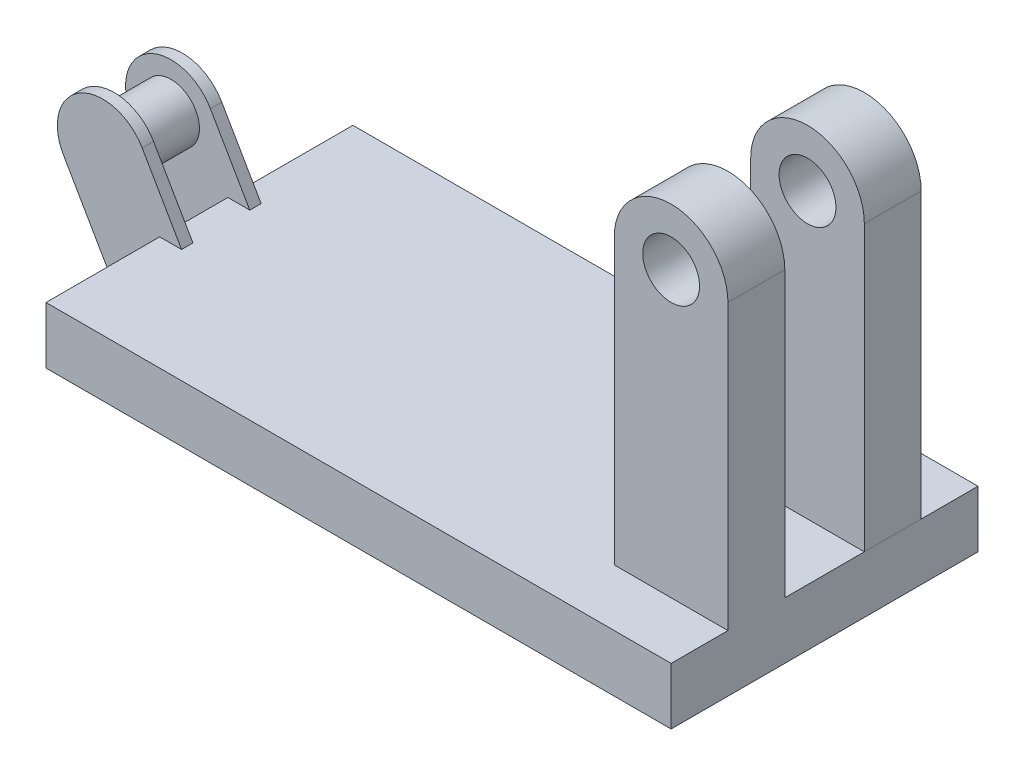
from build123d import *

# Parameters (mm, degrees)
SKIZZE1_W               = 550
SKIZZE1_H               = 270
LINEAR_AUSTRAGEN1_DEPTH = 50
LINEAR_START            = 35
SKIZZE2_R               = 25
LINEAR_AUSTRAGEN2_DEPTH = 50
SKIZZE3_R               = 25
LINEAR_AUSTRAGEN3_DEPTH = 25
LINEAR_AUSTRAGEN4_DEPTH = 10


with BuildPart() as part:
    # Skizze1 → Linear austragen1 (new body)
    with BuildSketch(Plane(origin=(0, 0, 0), x_dir=(1, 0, 0), z_dir=(0, 1, 0))):
        Rectangle(SKIZZE1_W, SKIZZE1_H)
    extrude(amount=LINEAR_AUSTRAGEN1_DEPTH)



with BuildPart() as body_2:
    # Skizze2 → Linear austragen2 (new body)
    with BuildSketch(Plane.XY.offset(LINEAR_START)):
        with BuildLine():
            Line((175, 50), (175, 300))
            ThreePointArc((175, 300), (225, 350), (275, 300))
            Line((275, 300), (275, 50))
            Line((275, 50), (175, 50))
        make_face()
        with Locations((225, 300)):
            Circle(SKIZZE2_R, mode=Mode.SUBTRACT)
    extrude(amount=LINEAR_AUSTRAGEN2_DEPTH)


with BuildPart() as body_3:
    # Spiegeln1: mirrored copy
    add(body_2.part.mirror(Plane.XY))


with BuildPart() as body_4:
    # Skizze3 → Linear austragen3 (new, symmetric)
    with BuildSketch(Plane.XY):
        with Locations((-325, 90)):
            Circle(SKIZZE3_R)
    extrude(amount=LINEAR_AUSTRAGEN3_DEPTH, both=True)


with BuildPart() as part_1:
    add(part.part)

    add(body_2.part)  # Linear austragen4 merges body 2

    add(body_4.part)  # Linear austragen4 merges body 4
    # Skizze4 → Linear austragen4 (add)
    with BuildSketch(Plane.XY.offset(25)):
        with BuildLine():
            Line((-275, 0), (-319.210884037, 0))
            Line((-319.210884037, 0), (-359.109321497, 69.106120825))
            ThreePointArc((-359.109321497, 69.106120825), (-345.448667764, 124.378074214), (-290.358983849, 110))
            Line((-290.358983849, 110), (-255.717967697, 50))
            Line((-255.717967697, 50), (275, 50))
            Line((275, 50), (275, 0))
            Line((275, 0), (-275, 0))
        make_face()
    linear_austragen4 = extrude(amount=LINEAR_AUSTRAGEN4_DEPTH)

    # Spiegeln2: Linear austragen4 across plane
    add(linear_austragen4.mirror(Plane.XY))


solid = Compound([body_3.part, part_1.part])
